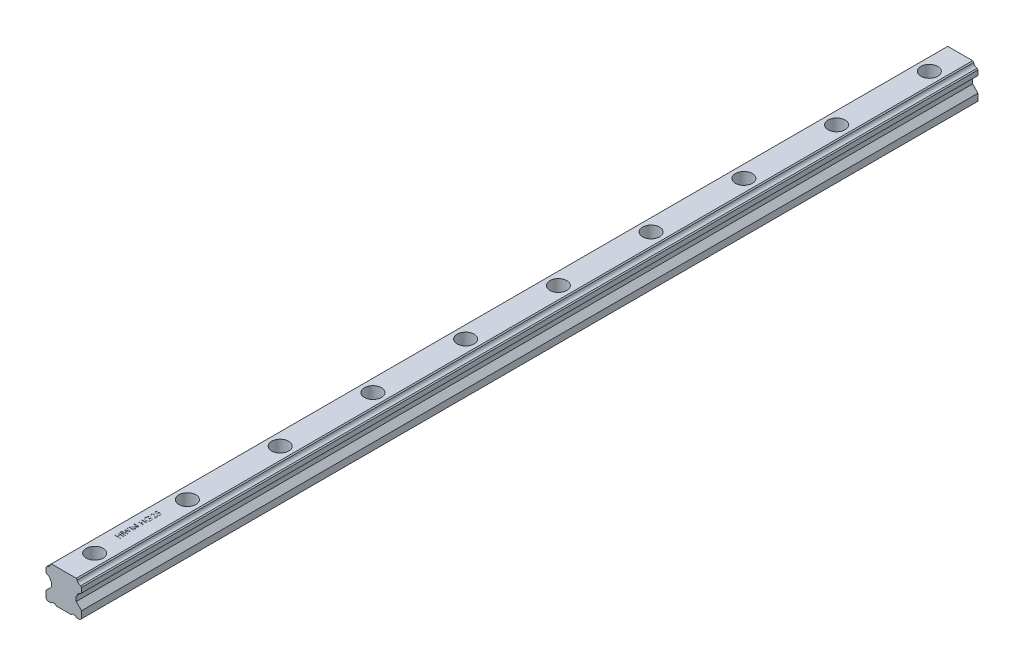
from build123d import *

# Parameters (mm, degrees)
EXTRUDE_1_DEPTH              = 580
HOLE_WIZARD_M6_1_D           = 7
HOLE_WIZARD_M6_1_CBORE_D     = 11
HOLE_WIZARD_M6_1_CBORE_DEPTH = 9
PATTERN_LINEAR_1_COUNT       = 10
PATTERN_LINEAR_1_PITCH       = 60
SKETCH_6_W                   = 3.5
SKETCH_6_H                   = 0.314102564
CUT_EXTRUDE_1_DEPTH          = 0.1


with BuildPart() as part:
    # Sketch 1 → Extrude 1 (new body)
    with BuildSketch(Plane.XY):
        with BuildLine():
            Line((8.05, 8.95), (8.05, 11.95))
            Line((8.05, 11.95), (8.699273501, 12.599273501))
            ThreePointArc((8.699273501, 12.599273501), (9.368413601, 14.081586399), (10.850726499, 14.750726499))
            Line((10.850726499, 14.750726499), (11.5, 15.4))
            Line((11.5, 15.4), (11.5, 18.55))
            Line((11.5, 18.55), (10.850726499, 19.199273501))
            ThreePointArc((10.850726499, 19.199273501), (9.368413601, 19.868413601), (8.699273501, 21.350726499))
            Line((8.699273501, 21.350726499), (8.05, 22))
            Line((8.05, 22), (-8.05, 22))
            Line((-8.05, 22), (-8.699273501, 21.350726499))
            ThreePointArc((-8.699273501, 21.350726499), (-9.368413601, 19.868413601), (-10.850726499, 19.199273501))
            Line((-10.850726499, 19.199273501), (-11.5, 18.55))
            Line((-11.5, 18.55), (-11.5, 15.4))
            Line((-11.5, 15.4), (-10.850726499, 14.750726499))
            ThreePointArc((-10.850726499, 14.750726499), (-9.368413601, 14.081586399), (-8.699273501, 12.599273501))
            Line((-8.699273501, 12.599273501), (-8.05, 11.95))
            Line((-8.05, 11.95), (-8.05, 8.95))
            Line((-8.05, 8.95), (-11.5, 5.5))
            Line((-11.5, 5.5), (-11.5, 1))
            Line((-11.5, 1), (-10.5, 0))
            Line((-10.5, 0), (-8.214285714, 0))
            Line((-8.214285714, 0), (-7.447619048, 0.766666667))
            Line((-7.447619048, 0.766666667), (-5.695238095, 0.766666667))
            Line((-5.695238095, 0.766666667), (-4.928571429, 0))
            Line((-4.928571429, 0), (4.928571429, 0))
            Line((4.928571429, 0), (5.695238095, 0.766666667))
            Line((5.695238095, 0.766666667), (7.447619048, 0.766666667))
            Line((7.447619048, 0.766666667), (8.214285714, 0))
            Line((8.214285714, 0), (10.5, 0))
            Line((10.5, 0), (11.5, 1))
            Line((11.5, 1), (11.5, 5.5))
            Line((11.5, 5.5), (8.05, 8.95))
        make_face()
    extrude(amount=-EXTRUDE_1_DEPTH)

    # Hole Wizard M6 _1 (through all)
    with Locations(Plane(origin=(-2.772540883, 22, -12.140035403), x_dir=(-1, 0, 0), z_dir=(0, 1, 0))):
        with Locations((-2.772540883, -7.859964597)):
            hole_wizard_m6_1 = CounterBoreHole(HOLE_WIZARD_M6_1_D / 2, HOLE_WIZARD_M6_1_CBORE_D / 2, HOLE_WIZARD_M6_1_CBORE_DEPTH)

    # Pattern Linear 1: Hole Wizard M6 _1 ×10
    with Locations(*[(0, 0, -i * PATTERN_LINEAR_1_PITCH) for i in range(1, PATTERN_LINEAR_1_COUNT)]):
        add(hole_wizard_m6_1, mode=Mode.SUBTRACT)

    # Sketch 6 → Cut-Extrude 1 (cut)
    with BuildSketch(Plane(origin=(0, 22, 0), x_dir=(1, 0, 0), z_dir=(0, 1, 0))):
        Polygon((-3.5, 36.403846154), (-3.5, 36.717948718), (-2.064102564, 36.717948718), (-2.064102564, 38.512820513), (-3.5, 38.512820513), (-3.5, 38.826923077), (0, 38.826923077), (0, 38.512820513), (-1.705128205, 38.512820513), (-1.705128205, 36.717948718), (0, 36.717948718), (0, 36.403846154), align=None)
        with Locations((-1.75, 39.881410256)):
            Rectangle(SKETCH_6_W, SKETCH_6_H)
        Polygon((-3.5, 40.576923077), (-3.5, 40.901542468), (-0.933193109, 41.586538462), (-3.5, 42.605268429), (-3.5, 42.650841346), (-0.950721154, 43.650641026), (-3.5, 44.339142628), (-3.5, 44.66025641), (0, 43.716546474), (0, 43.671674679), (-2.676883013, 42.618589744), (0, 41.552884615), (0, 41.508012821), align=None)
        with Locations((-1.75, 45.625)):
            Rectangle(SKETCH_6_W, SKETCH_6_H)
        Polygon((0, 46.544871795), (-3.5, 46.544871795), (-3.5, 46.610777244), (-0.745292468, 48.923076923), (-3.5, 48.923076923), (-3.5, 49.237179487), (0, 49.237179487), (0, 49.165665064), (-2.748397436, 46.858974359), (0, 46.858974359), align=None)
        Polygon((-3.5, 51.480769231), (-3.5, 51.794871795), (-2.064102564, 51.794871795), (-2.064102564, 53.58974359), (-3.5, 53.58974359), (-3.5, 53.903846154), (0, 53.903846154), (0, 53.58974359), (-1.705128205, 53.58974359), (-1.705128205, 51.794871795), (0, 51.794871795), (0, 51.480769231), align=None)
        with BuildLine():
            Line((-2.902644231, 58.076923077), (-2.647435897, 57.807692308))
            add(Edge.make_bspline(
                [(-2.647435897, 57.807692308), (-2.69328212, 57.758983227), (-2.783881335, 57.662726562), (-2.901244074, 57.50552662), (-3.002777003, 57.342170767), (-3.084772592, 57.172394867), (-3.149094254, 57.000650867), (-3.195850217, 56.829891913), (-3.225460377, 56.661223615), (-3.229016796, 56.549059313), (-3.230769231, 56.493790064)],
                knots=[0, 0, 0, 0, 1.089067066, 2.152164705, 3.18986567, 4.218445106, 5.218487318, 6.173592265, 7.100032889, 8, 8, 8, 8], degree=3))
            add(Edge.make_bspline(
                [(-3.230769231, 56.493790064), (-3.230355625, 56.459875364), (-3.229529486, 56.392133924), (-3.218985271, 56.29151198), (-3.203820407, 56.191945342), (-3.181878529, 56.093621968), (-3.15406947, 55.99635068), (-3.119284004, 55.900469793), (-3.078728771, 55.805800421), (-3.031866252, 55.713234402), (-2.980386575, 55.623493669), (-2.923337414, 55.538737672), (-2.862550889, 55.458421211), (-2.796491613, 55.384072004), (-2.725807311, 55.31519549), (-2.651770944, 55.250524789), (-2.572926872, 55.191265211), (-2.489599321, 55.138479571), (-2.403726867, 55.090811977), (-2.316037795, 55.049619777), (-2.227346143, 55.013809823), (-2.136984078, 54.986535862), (-2.045883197, 54.963434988), (-1.953566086, 54.947353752), (-1.859791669, 54.938257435), (-1.796993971, 54.936686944), (-1.765424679, 54.935897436)],
                knots=[0, 0, 0, 0, 1.028150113, 2.053633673, 3.06513288, 4.081487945, 5.106702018, 6.131327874, 7.172780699, 8.228344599, 9.276313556, 10.308389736, 11.324843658, 12.329040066, 13.321460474, 14.316307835, 15.308626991, 16.309440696, 17.305625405, 18.28535951, 19.246194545, 20.203493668, 21.145557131, 22.095268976, 23.042464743, 24, 24, 24, 24], degree=3))
            add(Edge.make_bspline(
                [(-1.765424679, 54.935897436), (-1.733154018, 54.936653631), (-1.668700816, 54.938163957), (-1.572504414, 54.947817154), (-1.477747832, 54.965772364), (-1.384282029, 54.989584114), (-1.291920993, 55.019856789), (-1.20076111, 55.057049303), (-1.110811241, 55.101355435), (-1.022964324, 55.152526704), (-0.937464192, 55.209036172), (-0.856251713, 55.271187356), (-0.780271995, 55.339084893), (-0.708415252, 55.411483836), (-0.641134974, 55.489043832), (-0.579242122, 55.572517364), (-0.521779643, 55.660735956), (-0.469378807, 55.753738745), (-0.42257144, 55.850542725), (-0.38094723, 55.949799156), (-0.346667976, 56.051827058), (-0.31872985, 56.156089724), (-0.295829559, 56.262463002), (-0.281097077, 56.371486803), (-0.270406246, 56.482359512), (-0.269624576, 56.557098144), (-0.269230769, 56.594751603)],
                knots=[0, 0, 0, 0, 0.935915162, 1.869274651, 2.799799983, 3.730201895, 4.664668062, 5.616159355, 6.583070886, 7.570012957, 8.562524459, 9.553461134, 10.53281078, 11.515274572, 12.509912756, 13.507571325, 14.526460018, 15.561318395, 16.601025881, 17.643204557, 18.680545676, 19.719612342, 20.772381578, 21.833430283, 22.908478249, 24, 24, 24, 24], degree=3))
            add(Edge.make_bspline(
                [(-0.269230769, 56.594751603), (-0.270178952, 56.640130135), (-0.272040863, 56.729238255), (-0.286546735, 56.860222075), (-0.309173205, 56.986034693), (-0.342412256, 57.106266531), (-0.384484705, 57.221353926), (-0.436513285, 57.330872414), (-0.497950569, 57.435124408), (-0.567552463, 57.533658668), (-0.645100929, 57.624132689), (-0.728035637, 57.706474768), (-0.817431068, 57.77785339), (-0.911954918, 57.840400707), (-1.012511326, 57.892097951), (-1.118540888, 57.934543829), (-1.230109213, 57.967076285), (-1.307200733, 57.980431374), (-1.346153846, 57.987179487)],
                knots=[0, 0, 0, 0, 1.130199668, 2.219330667, 3.279027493, 4.311506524, 5.322739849, 6.327972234, 7.327472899, 8.33386792, 9.329086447, 10.29244429, 11.240784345, 12.174119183, 13.111530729, 14.052100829, 15.015757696, 16, 16, 16, 16], degree=3))
            Line((-1.346153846, 57.987179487), (-1.346153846, 56.820512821))
            Line((-1.346153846, 56.820512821), (-1.705128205, 56.820512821))
            Line((-1.705128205, 56.820512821), (-1.705128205, 58.301282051))
            add(Edge.make_bspline(
                [(-1.705128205, 58.301282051), (-1.638220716, 58.299576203), (-1.507270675, 58.296237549), (-1.316300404, 58.272818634), (-1.13592871, 58.235002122), (-0.965965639, 58.18334181), (-0.806652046, 58.116466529), (-0.65782618, 58.035094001), (-0.520449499, 57.93792188), (-0.393400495, 57.828411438), (-0.280071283, 57.705511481), (-0.180465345, 57.572542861), (-0.09656273, 57.429285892), (-0.028302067, 57.275876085), (0.024971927, 57.112815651), (0.062743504, 56.939727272), (0.085373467, 56.756845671), (0.088264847, 56.631508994), (0.08974359, 56.567407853)],
                knots=[0, 0, 0, 0, 1.140356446, 2.231883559, 3.274166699, 4.278491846, 5.25512956, 6.21435461, 7.1637429, 8.11826594, 9.068280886, 10.0076534, 10.945064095, 11.891975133, 12.864533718, 13.863980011, 14.907571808, 16, 16, 16, 16], degree=3))
            add(Edge.make_bspline(
                [(0.08974359, 56.567407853), (0.089174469, 56.527897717), (0.088051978, 56.449970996), (0.080074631, 56.334880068), (0.067794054, 56.222962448), (0.049248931, 56.114234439), (0.026534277, 56.008296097), (-0.002552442, 55.905676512), (-0.036221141, 55.80598477), (-0.074516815, 55.709066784), (-0.118888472, 55.615802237), (-0.168198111, 55.52577572), (-0.222191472, 55.438489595), (-0.281802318, 55.35453843), (-0.346584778, 55.273484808), (-0.416668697, 55.195851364), (-0.491839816, 55.121203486), (-0.545218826, 55.074443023), (-0.572115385, 55.05088141)],
                knots=[0, 0, 0, 0, 1.107784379, 2.184907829, 3.233506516, 4.263428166, 5.276301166, 6.270063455, 7.25232949, 8.225834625, 9.190232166, 10.146266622, 11.1027726, 12.066435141, 13.031522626, 14.010570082, 14.99756817, 16, 16, 16, 16], degree=3))
            add(Edge.make_bspline(
                [(-0.572115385, 55.05088141), (-0.614786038, 55.016695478), (-0.699419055, 54.948891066), (-0.835018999, 54.861612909), (-0.975420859, 54.787211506), (-1.121015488, 54.726843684), (-1.271666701, 54.679705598), (-1.427181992, 54.645899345), (-1.587761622, 54.626092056), (-1.696426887, 54.623238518), (-1.751402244, 54.621794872)],
                knots=[0, 0, 0, 0, 1.023165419, 2.029347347, 3.013907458, 3.994755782, 4.975994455, 5.96558838, 6.970761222, 8, 8, 8, 8], degree=3))
            add(Edge.make_bspline(
                [(-1.751402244, 54.621794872), (-1.792568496, 54.62232711), (-1.874377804, 54.623384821), (-1.99583511, 54.636210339), (-2.115135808, 54.654611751), (-2.232182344, 54.681658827), (-2.347053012, 54.715755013), (-2.45980069, 54.758308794), (-2.570493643, 54.807852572), (-2.67836343, 54.865442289), (-2.782003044, 54.929511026), (-2.880905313, 54.999118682), (-2.973467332, 55.074802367), (-3.059903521, 55.156782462), (-3.141494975, 55.243406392), (-3.216537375, 55.336492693), (-3.286205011, 55.434631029), (-3.349159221, 55.538582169), (-3.405727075, 55.6467058), (-3.455315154, 55.758766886), (-3.496298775, 55.874724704), (-3.531072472, 55.993712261), (-3.556787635, 56.11662974), (-3.575436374, 56.242585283), (-3.588196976, 56.372235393), (-3.589223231, 56.459871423), (-3.58974359, 56.504306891)],
                knots=[0, 0, 0, 0, 1.00895651, 2.005089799, 2.991467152, 3.967318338, 4.948153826, 5.927364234, 6.919980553, 7.91976625, 8.923240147, 9.905815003, 10.88314567, 11.851989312, 12.825009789, 13.798721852, 14.781296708, 15.773896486, 16.776076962, 17.771600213, 18.775744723, 19.78957137, 20.808953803, 21.851964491, 22.910847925, 24, 24, 24, 24], degree=3))
            add(Edge.make_bspline(
                [(-3.58974359, 56.504306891), (-3.589164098, 56.540545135), (-3.588015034, 56.612401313), (-3.580050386, 56.719327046), (-3.567426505, 56.82460006), (-3.550199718, 56.92837645), (-3.526736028, 57.030302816), (-3.498657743, 57.130669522), (-3.46596592, 57.229622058), (-3.426977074, 57.326850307), (-3.382723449, 57.423008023), (-3.332910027, 57.518629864), (-3.276685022, 57.61338911), (-3.213881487, 57.707450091), (-3.145578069, 57.801405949), (-3.069821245, 57.893770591), (-2.989598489, 57.986773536), (-2.931916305, 58.04657535), (-2.902644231, 58.076923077)],
                knots=[0, 0, 0, 0, 0.985871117, 1.954866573, 2.915460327, 3.869826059, 4.81536089, 5.759505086, 6.70452669, 7.649098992, 8.607881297, 9.583363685, 10.581137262, 11.603961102, 12.659522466, 13.73993555, 14.853081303, 16, 16, 16, 16], degree=3))
        make_face()
        with BuildLine():
            Line((-2.423076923, 59.153846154), (-2.423076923, 58.83974359))
            add(Edge.make_bspline(
                [(-2.423076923, 58.83974359), (-2.464747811, 58.841790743), (-2.546588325, 58.845811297), (-2.665912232, 58.864639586), (-2.779967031, 58.891580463), (-2.887836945, 58.929671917), (-2.990475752, 58.976978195), (-3.087475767, 59.033708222), (-3.178466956, 59.100902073), (-3.262605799, 59.177108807), (-3.33979337, 59.259877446), (-3.406448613, 59.349183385), (-3.462766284, 59.443028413), (-3.509847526, 59.541127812), (-3.545187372, 59.644588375), (-3.571409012, 59.752471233), (-3.587185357, 59.86525037), (-3.588881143, 59.942090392), (-3.58974359, 59.981169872)],
                knots=[0, 0, 0, 0, 1.10065271, 2.161652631, 3.183658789, 4.190468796, 5.17591951, 6.163126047, 7.15150782, 8.156236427, 9.156009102, 10.134482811, 11.092018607, 12.041330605, 13.001268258, 13.972401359, 14.968799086, 16, 16, 16, 16], degree=3))
            add(Edge.make_bspline(
                [(-3.58974359, 59.981169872), (-3.588852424, 60.019550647), (-3.587101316, 60.094967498), (-3.571837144, 60.204991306), (-3.54844616, 60.309980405), (-3.513784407, 60.408744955), (-3.47029149, 60.502298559), (-3.416202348, 60.589482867), (-3.354076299, 60.672406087), (-3.280795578, 60.746998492), (-3.202604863, 60.815520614), (-3.119097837, 60.874582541), (-3.032749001, 60.925447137), (-2.942883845, 60.96707822), (-2.849209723, 60.998636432), (-2.752624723, 61.022018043), (-2.652014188, 61.035384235), (-2.583905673, 61.037424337), (-2.549278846, 61.038461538)],
                knots=[0, 0, 0, 0, 1.111674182, 2.184400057, 3.212814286, 4.223731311, 5.211378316, 6.196328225, 7.191884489, 8.207283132, 9.220262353, 10.201199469, 11.166417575, 12.120932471, 13.06540007, 14.026332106, 14.996573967, 16, 16, 16, 16], degree=3))
            add(Edge.make_bspline(
                [(-2.549278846, 61.038461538), (-2.500531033, 61.036768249), (-2.403890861, 61.033411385), (-2.26187569, 61.004697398), (-2.124283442, 60.959849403), (-2.013542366, 60.905856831), (-1.924317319, 60.851373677), (-1.850817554, 60.80232555), (-1.771698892, 60.744580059), (-1.686641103, 60.678630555), (-1.59675809, 60.603341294), (-1.500215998, 60.520668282), (-1.398799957, 60.428476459), (-1.329486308, 60.363827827), (-1.293569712, 60.330328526)],
                knots=[0, 0, 0, 0, 1.184416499, 2.348048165, 3.509039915, 4.696071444, 5.333504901, 6.05069495, 6.844171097, 7.714965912, 8.667477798, 9.695072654, 10.805644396, 12, 12, 12, 12], degree=3))
            Line((-1.293569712, 60.330328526), (-0.358974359, 59.454627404))
            Line((-0.358974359, 59.454627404), (-0.358974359, 61.083333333))
            Line((-0.358974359, 61.083333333), (0, 61.083333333))
            Line((0, 61.083333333), (0, 58.705128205))
            Line((0, 58.705128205), (-1.448517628, 60.0625))
            add(Edge.make_bspline(
                [(-1.448517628, 60.0625), (-1.483015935, 60.095547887), (-1.549280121, 60.159026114), (-1.646023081, 60.248808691), (-1.735772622, 60.329447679), (-1.818359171, 60.401465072), (-1.894990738, 60.463298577), (-1.963185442, 60.518170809), (-2.025939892, 60.5621364), (-2.098680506, 60.609851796), (-2.187492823, 60.656065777), (-2.296026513, 60.695778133), (-2.407753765, 60.719992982), (-2.483255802, 60.722897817), (-2.521233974, 60.724358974)],
                knots=[0, 0, 0, 0, 1.329631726, 2.553950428, 3.673215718, 4.687767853, 5.603093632, 6.413772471, 7.123043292, 7.734684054, 8.834405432, 9.900288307, 10.943827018, 12, 12, 12, 12], degree=3))
            add(Edge.make_bspline(
                [(-2.521233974, 60.724358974), (-2.545115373, 60.723723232), (-2.592181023, 60.722470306), (-2.661186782, 60.711412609), (-2.727751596, 60.694702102), (-2.792080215, 60.670756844), (-2.853525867, 60.639150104), (-2.912163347, 60.600676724), (-2.968852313, 60.556286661), (-3.022005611, 60.504935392), (-3.070686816, 60.448523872), (-3.113810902, 60.388929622), (-3.149850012, 60.325879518), (-3.179393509, 60.259639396), (-3.202568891, 60.190393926), (-3.21862747, 60.118009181), (-3.228709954, 60.042685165), (-3.230074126, 59.991251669), (-3.230769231, 59.965044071)],
                knots=[0, 0, 0, 0, 0.991446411, 1.95395049, 2.89581595, 3.838931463, 4.798493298, 5.75982156, 6.748411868, 7.785213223, 8.824556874, 9.840280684, 10.836137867, 11.835679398, 12.848801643, 13.863922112, 14.911575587, 16, 16, 16, 16], degree=3))
            add(Edge.make_bspline(
                [(-3.230769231, 59.965044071), (-3.230082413, 59.937666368), (-3.228733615, 59.88390108), (-3.218517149, 59.80512929), (-3.203028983, 59.72946555), (-3.178430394, 59.65803883), (-3.149365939, 59.589302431), (-3.11244268, 59.524723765), (-3.069537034, 59.46323063), (-3.019786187, 59.405834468), (-2.963887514, 59.353413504), (-2.902283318, 59.306707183), (-2.835417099, 59.266166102), (-2.76356329, 59.230744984), (-2.686006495, 59.20199263), (-2.603039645, 59.180018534), (-2.515018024, 59.162631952), (-2.454232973, 59.156823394), (-2.423076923, 59.153846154)],
                knots=[0, 0, 0, 0, 1.030878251, 2.024474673, 2.987898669, 3.934362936, 4.864849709, 5.795128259, 6.730474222, 7.685293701, 8.650606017, 9.611896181, 10.591709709, 11.591680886, 12.625074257, 13.701333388, 14.821793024, 16, 16, 16, 16], degree=3))
        make_face()
        with BuildLine():
            Line((-3.5, 63.596153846), (-3.141025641, 63.596153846))
            Line((-3.141025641, 63.596153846), (-3.141025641, 62.405649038))
            Line((-3.141025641, 62.405649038), (-2.220452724, 62.217047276))
            add(Edge.make_bspline(
                [(-2.220452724, 62.217047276), (-2.230682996, 62.25410315), (-2.25050253, 62.325893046), (-2.2725083, 62.431852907), (-2.285773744, 62.53244511), (-2.287585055, 62.597720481), (-2.288461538, 62.629306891)],
                knots=[0, 0, 0, 0, 1.100273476, 2.13160584, 3.095893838, 4, 4, 4, 4], degree=3))
            add(Edge.make_bspline(
                [(-2.288461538, 62.629306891), (-2.28764354, 62.668397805), (-2.28603515, 62.745260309), (-2.269673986, 62.857544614), (-2.245976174, 62.96527195), (-2.209465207, 63.066851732), (-2.164878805, 63.163891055), (-2.108721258, 63.254723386), (-2.04315746, 63.34062356), (-1.968525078, 63.420997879), (-1.885534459, 63.493570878), (-1.795933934, 63.556634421), (-1.701678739, 63.611677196), (-1.600559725, 63.654605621), (-1.494484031, 63.689639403), (-1.382227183, 63.712740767), (-1.264785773, 63.728171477), (-1.18448027, 63.729891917), (-1.143529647, 63.730769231)],
                knots=[0, 0, 0, 0, 1.052805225, 2.070078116, 3.052532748, 4.020689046, 4.973125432, 5.925915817, 6.89216474, 7.881560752, 8.877013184, 9.857446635, 10.830895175, 11.812622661, 12.812548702, 13.836681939, 14.896847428, 16, 16, 16, 16], degree=3))
            add(Edge.make_bspline(
                [(-1.143529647, 63.730769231), (-1.115007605, 63.730103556), (-1.058348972, 63.728781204), (-0.974202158, 63.7220714), (-0.891849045, 63.709103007), (-0.811440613, 63.69190289), (-0.732901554, 63.668941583), (-0.65579213, 63.642084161), (-0.580956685, 63.608702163), (-0.508064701, 63.571694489), (-0.437950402, 63.530715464), (-0.372294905, 63.484635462), (-0.309599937, 63.436755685), (-0.251727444, 63.384438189), (-0.198452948, 63.328277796), (-0.149513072, 63.268586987), (-0.104029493, 63.205907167), (-0.063861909, 63.139251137), (-0.026898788, 63.070108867), (0.003424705, 62.997480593), (0.030535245, 62.923019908), (0.05214477, 62.845655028), (0.069077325, 62.765561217), (0.080577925, 62.682606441), (0.088954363, 62.597225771), (0.08947872, 62.539350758), (0.08974359, 62.510116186)],
                knots=[0, 0, 0, 0, 1.056393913, 2.098511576, 3.122979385, 4.141471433, 5.141222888, 6.151259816, 7.162667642, 8.172852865, 9.177685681, 10.166741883, 11.141342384, 12.097242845, 13.052202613, 14.005160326, 14.953864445, 15.917140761, 16.884916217, 17.854238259, 18.828761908, 19.81781811, 20.826036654, 21.857789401, 22.917898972, 24, 24, 24, 24], degree=3))
            add(Edge.make_bspline(
                [(0.08974359, 62.510116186), (0.089050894, 62.475242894), (0.087688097, 62.406633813), (0.073496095, 62.30610057), (0.053035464, 62.209432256), (0.022721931, 62.117043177), (-0.016971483, 62.029318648), (-0.064133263, 61.945002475), (-0.12027864, 61.865139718), (-0.184894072, 61.790276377), (-0.255892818, 61.721460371), (-0.332202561, 61.65905751), (-0.413920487, 61.604193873), (-0.500780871, 61.556670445), (-0.592629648, 61.516184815), (-0.689749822, 61.484366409), (-0.791650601, 61.45868899), (-0.861804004, 61.447825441), (-0.897435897, 61.442307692)],
                knots=[0, 0, 0, 0, 1.046872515, 2.059598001, 3.044168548, 4.012104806, 4.973680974, 5.932408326, 6.910122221, 7.900780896, 8.89867654, 9.876692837, 10.858029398, 11.85084981, 12.847361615, 13.868568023, 14.917415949, 16, 16, 16, 16], degree=3))
            Line((-0.897435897, 61.442307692), (-0.897435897, 61.756410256))
            add(Edge.make_bspline(
                [(-0.897435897, 61.756410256), (-0.86405597, 61.764133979), (-0.799897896, 61.778979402), (-0.709812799, 61.811649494), (-0.62950762, 61.851206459), (-0.558491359, 61.899340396), (-0.495464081, 61.955133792), (-0.43989307, 62.019990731), (-0.389697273, 62.092289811), (-0.347784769, 62.17267219), (-0.312479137, 62.257640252), (-0.287283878, 62.346063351), (-0.272032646, 62.436668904), (-0.270168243, 62.497671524), (-0.269230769, 62.528345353)],
                knots=[0, 0, 0, 0, 1.13623081, 2.183898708, 3.172478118, 4.09966615, 5.022692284, 5.957376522, 6.927682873, 7.937366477, 8.960015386, 9.976409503, 10.982481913, 12, 12, 12, 12], degree=3))
            add(Edge.make_bspline(
                [(-0.269230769, 62.528345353), (-0.270058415, 62.558301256), (-0.271688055, 62.617284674), (-0.284028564, 62.704132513), (-0.303533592, 62.787735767), (-0.33085902, 62.868242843), (-0.367008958, 62.945258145), (-0.411417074, 63.018672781), (-0.462975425, 63.089532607), (-0.521904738, 63.1559727), (-0.586881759, 63.216808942), (-0.656357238, 63.270565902), (-0.730474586, 63.315342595), (-0.807947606, 63.353076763), (-0.889626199, 63.381730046), (-0.975127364, 63.402171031), (-1.064662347, 63.414174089), (-1.125731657, 63.415825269), (-1.156850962, 63.416666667)],
                knots=[0, 0, 0, 0, 1.027268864, 2.022700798, 3.002744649, 3.968653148, 4.933396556, 5.915045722, 6.907600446, 7.935526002, 8.956456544, 9.95700807, 10.942805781, 11.92166854, 12.907987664, 13.905483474, 14.932689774, 16, 16, 16, 16], degree=3))
            add(Edge.make_bspline(
                [(-1.156850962, 63.416666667), (-1.184930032, 63.416028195), (-1.239659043, 63.414783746), (-1.320009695, 63.404010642), (-1.396158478, 63.386014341), (-1.468436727, 63.360391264), (-1.536613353, 63.328412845), (-1.600538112, 63.288262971), (-1.660812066, 63.241651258), (-1.715884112, 63.187233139), (-1.766793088, 63.12803749), (-1.810034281, 63.062543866), (-1.846807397, 62.992500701), (-1.876936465, 62.917778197), (-1.900936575, 62.838284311), (-1.917523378, 62.753976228), (-1.92744867, 62.664834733), (-1.928795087, 62.603859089), (-1.929487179, 62.572516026)],
                knots=[0, 0, 0, 0, 1.045723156, 2.038222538, 3.013889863, 3.95567481, 4.890389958, 5.81331128, 6.76251276, 7.723027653, 8.692928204, 9.666105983, 10.639751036, 11.635719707, 12.66315958, 13.728667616, 14.832476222, 16, 16, 16, 16], degree=3))
            add(Edge.make_bspline(
                [(-1.929487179, 62.572516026), (-1.928906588, 62.545387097), (-1.927707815, 62.489372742), (-1.918881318, 62.403449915), (-1.904642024, 62.313158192), (-1.885055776, 62.218843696), (-1.859424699, 62.120223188), (-1.828710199, 62.017504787), (-1.7919882, 61.910472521), (-1.764255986, 61.838354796), (-1.75, 61.801282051)],
                knots=[0, 0, 0, 0, 0.817624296, 1.688186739, 2.600797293, 3.572016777, 4.590301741, 5.671205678, 6.80286297, 8, 8, 8, 8], degree=3))
            Line((-1.75, 61.801282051), (-3.5, 62.16025641))
            Line((-3.5, 62.16025641), (-3.5, 63.596153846))
        make_face()
    extrude(amount=-CUT_EXTRUDE_1_DEPTH, mode=Mode.SUBTRACT)


solid = part.part
